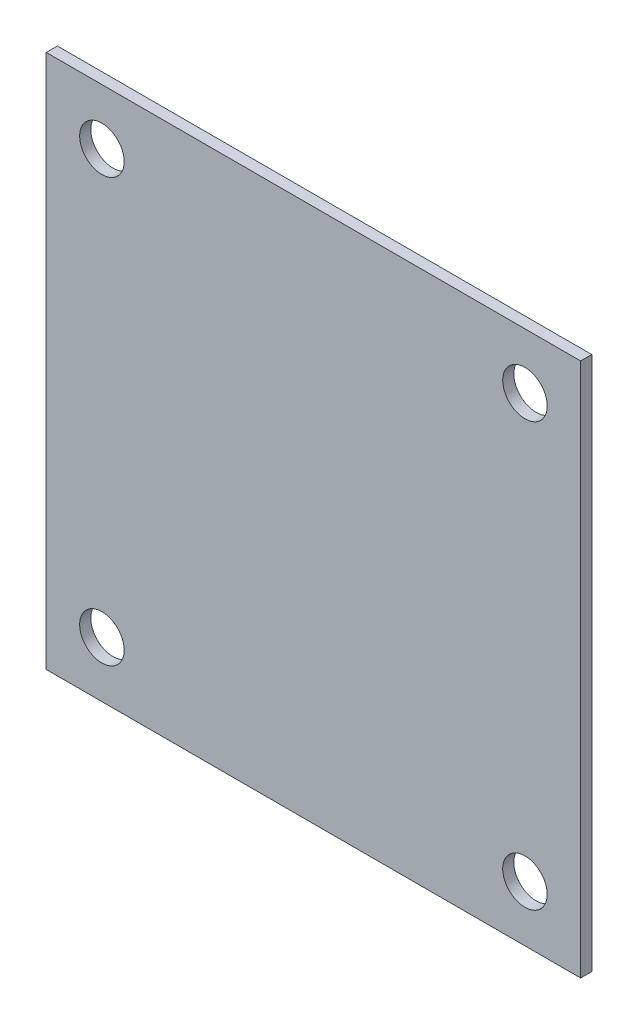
ISO-10303-21;
HEADER;
FILE_DESCRIPTION(('STEP AP214'),'2;1');
FILE_NAME('part.step','',(''),(''),'','','');
FILE_SCHEMA(('AUTOMOTIVE_DESIGN { 1 0 10303 214 1 1 1 1 }'));
ENDSEC;
DATA;
#1=APPLICATION_CONTEXT('core data for automotive mechanical design processes');
#2=APPLICATION_PROTOCOL_DEFINITION('international standard','automotive_design',2000,#1);
#3=PRODUCT_CONTEXT('',#1,'mechanical');
#4=PRODUCT('Part','Part','',(#3));
#5=PRODUCT_RELATED_PRODUCT_CATEGORY('part','',(#4));
#6=PRODUCT_DEFINITION_FORMATION('','',#4);
#7=PRODUCT_DEFINITION_CONTEXT('part definition',#1,'design');
#8=PRODUCT_DEFINITION('design','',#6,#7);
#9=PRODUCT_DEFINITION_SHAPE('','',#8);
#10=(LENGTH_UNIT() NAMED_UNIT(*) SI_UNIT(.MILLI.,.METRE.));
#11=(NAMED_UNIT(*) PLANE_ANGLE_UNIT() SI_UNIT($,.RADIAN.));
#12=(NAMED_UNIT(*) SI_UNIT($,.STERADIAN.) SOLID_ANGLE_UNIT());
#13=UNCERTAINTY_MEASURE_WITH_UNIT(LENGTH_MEASURE(1.E-05),#10,'distance_accuracy_value','');
#14=(GEOMETRIC_REPRESENTATION_CONTEXT(3) GLOBAL_UNCERTAINTY_ASSIGNED_CONTEXT((#13)) GLOBAL_UNIT_ASSIGNED_CONTEXT((#10,
#11,#12)) REPRESENTATION_CONTEXT('',''));
#15=CARTESIAN_POINT('',(0.,0.,0.));
#16=DIRECTION('',(0.,0.,1.));
#17=DIRECTION('',(1.,0.,0.));
#18=AXIS2_PLACEMENT_3D('',#15,#16,#17);
#19=CARTESIAN_POINT('',(0.,0.,3.175));
#20=DIRECTION('',(0.,0.,1.));
#21=DIRECTION('',(1.,0.,0.));
#22=AXIS2_PLACEMENT_3D('',#19,#20,#21);
#23=PLANE('',#22);
#24=CARTESIAN_POINT('',(60.325,-60.325,3.175));
#25=DIRECTION('',(0.,0.,1.));
#26=DIRECTION('',(1.,0.,0.));
#27=AXIS2_PLACEMENT_3D('',#24,#25,#26);
#28=CIRCLE('',#27,6.35);
#29=CARTESIAN_POINT('',(66.675,-60.325,3.175));
#30=VERTEX_POINT('',#29);
#31=EDGE_CURVE('E148',#30,#30,#28,.T.);
#32=ORIENTED_EDGE('',*,*,#31,.F.);
#33=EDGE_LOOP('',(#32));
#34=FACE_BOUND('',#33,.T.);
#35=CARTESIAN_POINT('',(-60.325,60.325,3.175));
#36=DIRECTION('',(0.,0.,1.));
#37=DIRECTION('',(1.,0.,0.));
#38=AXIS2_PLACEMENT_3D('',#35,#36,#37);
#39=CIRCLE('',#38,6.35);
#40=CARTESIAN_POINT('',(-53.975,60.325,3.175));
#41=VERTEX_POINT('',#40);
#42=EDGE_CURVE('E118',#41,#41,#39,.T.);
#43=ORIENTED_EDGE('',*,*,#42,.F.);
#44=EDGE_LOOP('',(#43));
#45=FACE_BOUND('',#44,.T.);
#46=DIRECTION('',(0.,-1.,0.));
#47=VECTOR('',#46,1.);
#48=CARTESIAN_POINT('',(-76.2,76.2,3.175));
#49=LINE('',#48,#47);
#50=CARTESIAN_POINT('',(-76.2,76.2,3.175));
#51=VERTEX_POINT('',#50);
#52=CARTESIAN_POINT('',(-76.2,-76.2,3.175));
#53=VERTEX_POINT('',#52);
#54=EDGE_CURVE('E98',#51,#53,#49,.T.);
#55=ORIENTED_EDGE('',*,*,#54,.T.);
#56=DIRECTION('',(1.,0.,0.));
#57=VECTOR('',#56,1.);
#58=CARTESIAN_POINT('',(-76.2,-76.2,3.175));
#59=LINE('',#58,#57);
#60=CARTESIAN_POINT('',(76.2,-76.2,3.175));
#61=VERTEX_POINT('',#60);
#62=EDGE_CURVE('E93',#53,#61,#59,.T.);
#63=ORIENTED_EDGE('',*,*,#62,.T.);
#64=DIRECTION('',(0.,1.,0.));
#65=VECTOR('',#64,1.);
#66=CARTESIAN_POINT('',(76.2,76.2,3.175));
#67=LINE('',#66,#65);
#68=CARTESIAN_POINT('',(76.2,76.2,3.175));
#69=VERTEX_POINT('',#68);
#70=EDGE_CURVE('E96',#61,#69,#67,.T.);
#71=ORIENTED_EDGE('',*,*,#70,.T.);
#72=DIRECTION('',(-1.,0.,0.));
#73=VECTOR('',#72,1.);
#74=CARTESIAN_POINT('',(-76.2,76.2,3.175));
#75=LINE('',#74,#73);
#76=EDGE_CURVE('E63',#69,#51,#75,.T.);
#77=ORIENTED_EDGE('',*,*,#76,.T.);
#78=EDGE_LOOP('',(#55,#63,#71,#77));
#79=FACE_BOUND('',#78,.T.);
#80=CARTESIAN_POINT('',(60.325,60.325,3.175));
#81=DIRECTION('',(0.,0.,1.));
#82=DIRECTION('',(-1.,0.,0.));
#83=AXIS2_PLACEMENT_3D('',#80,#81,#82);
#84=CIRCLE('',#83,6.35);
#85=CARTESIAN_POINT('',(53.975,60.325,3.175));
#86=VERTEX_POINT('',#85);
#87=EDGE_CURVE('E140',#86,#86,#84,.T.);
#88=ORIENTED_EDGE('',*,*,#87,.F.);
#89=EDGE_LOOP('',(#88));
#90=FACE_BOUND('',#89,.T.);
#91=CARTESIAN_POINT('',(-60.325,-60.325,3.175));
#92=DIRECTION('',(0.,0.,1.));
#93=DIRECTION('',(-1.,0.,0.));
#94=AXIS2_PLACEMENT_3D('',#91,#92,#93);
#95=CIRCLE('',#94,6.35);
#96=CARTESIAN_POINT('',(-66.675,-60.325,3.175));
#97=VERTEX_POINT('',#96);
#98=EDGE_CURVE('E156',#97,#97,#95,.T.);
#99=ORIENTED_EDGE('',*,*,#98,.F.);
#100=EDGE_LOOP('',(#99));
#101=FACE_BOUND('',#100,.T.);
#102=ADVANCED_FACE('F45',(#34,#45,#79,#90,#101),#23,.T.);
#103=CARTESIAN_POINT('',(0.,0.,0.));
#104=DIRECTION('',(0.,0.,1.));
#105=DIRECTION('',(1.,0.,0.));
#106=AXIS2_PLACEMENT_3D('',#103,#104,#105);
#107=PLANE('',#106);
#108=DIRECTION('',(0.,-1.,0.));
#109=VECTOR('',#108,1.);
#110=CARTESIAN_POINT('',(-76.2,76.2,0.));
#111=LINE('',#110,#109);
#112=CARTESIAN_POINT('',(-76.2,76.2,0.));
#113=VERTEX_POINT('',#112);
#114=CARTESIAN_POINT('',(-76.2,-76.2,0.));
#115=VERTEX_POINT('',#114);
#116=EDGE_CURVE('E114',#113,#115,#111,.T.);
#117=ORIENTED_EDGE('',*,*,#116,.F.);
#118=DIRECTION('',(-1.,0.,0.));
#119=VECTOR('',#118,1.);
#120=CARTESIAN_POINT('',(-76.2,76.2,0.));
#121=LINE('',#120,#119);
#122=CARTESIAN_POINT('',(76.2,76.2,0.));
#123=VERTEX_POINT('',#122);
#124=EDGE_CURVE('E86',#123,#113,#121,.T.);
#125=ORIENTED_EDGE('',*,*,#124,.F.);
#126=DIRECTION('',(0.,1.,0.));
#127=VECTOR('',#126,1.);
#128=CARTESIAN_POINT('',(76.2,76.2,0.));
#129=LINE('',#128,#127);
#130=CARTESIAN_POINT('',(76.2,-76.2,0.));
#131=VERTEX_POINT('',#130);
#132=EDGE_CURVE('E80',#131,#123,#129,.T.);
#133=ORIENTED_EDGE('',*,*,#132,.F.);
#134=DIRECTION('',(1.,0.,0.));
#135=VECTOR('',#134,1.);
#136=CARTESIAN_POINT('',(-76.2,-76.2,0.));
#137=LINE('',#136,#135);
#138=EDGE_CURVE('E103',#115,#131,#137,.T.);
#139=ORIENTED_EDGE('',*,*,#138,.F.);
#140=EDGE_LOOP('',(#117,#125,#133,#139));
#141=FACE_BOUND('',#140,.T.);
#142=CARTESIAN_POINT('',(-60.325,60.325,0.));
#143=DIRECTION('',(0.,0.,1.));
#144=DIRECTION('',(1.,0.,0.));
#145=AXIS2_PLACEMENT_3D('',#142,#143,#144);
#146=CIRCLE('',#145,6.35);
#147=CARTESIAN_POINT('',(-53.975,60.325,0.));
#148=VERTEX_POINT('',#147);
#149=EDGE_CURVE('E136',#148,#148,#146,.T.);
#150=ORIENTED_EDGE('',*,*,#149,.T.);
#151=EDGE_LOOP('',(#150));
#152=FACE_BOUND('',#151,.T.);
#153=CARTESIAN_POINT('',(60.325,60.325,0.));
#154=DIRECTION('',(0.,0.,1.));
#155=DIRECTION('',(-1.,0.,0.));
#156=AXIS2_PLACEMENT_3D('',#153,#154,#155);
#157=CIRCLE('',#156,6.35);
#158=CARTESIAN_POINT('',(53.975,60.325,0.));
#159=VERTEX_POINT('',#158);
#160=EDGE_CURVE('E144',#159,#159,#157,.T.);
#161=ORIENTED_EDGE('',*,*,#160,.T.);
#162=EDGE_LOOP('',(#161));
#163=FACE_BOUND('',#162,.T.);
#164=CARTESIAN_POINT('',(60.325,-60.325,0.));
#165=DIRECTION('',(0.,0.,1.));
#166=DIRECTION('',(1.,0.,0.));
#167=AXIS2_PLACEMENT_3D('',#164,#165,#166);
#168=CIRCLE('',#167,6.35);
#169=CARTESIAN_POINT('',(66.675,-60.325,0.));
#170=VERTEX_POINT('',#169);
#171=EDGE_CURVE('E152',#170,#170,#168,.T.);
#172=ORIENTED_EDGE('',*,*,#171,.T.);
#173=EDGE_LOOP('',(#172));
#174=FACE_BOUND('',#173,.T.);
#175=CARTESIAN_POINT('',(-60.325,-60.325,0.));
#176=DIRECTION('',(0.,0.,1.));
#177=DIRECTION('',(-1.,0.,0.));
#178=AXIS2_PLACEMENT_3D('',#175,#176,#177);
#179=CIRCLE('',#178,6.35);
#180=CARTESIAN_POINT('',(-66.675,-60.325,0.));
#181=VERTEX_POINT('',#180);
#182=EDGE_CURVE('E160',#181,#181,#179,.T.);
#183=ORIENTED_EDGE('',*,*,#182,.T.);
#184=EDGE_LOOP('',(#183));
#185=FACE_BOUND('',#184,.T.);
#186=ADVANCED_FACE('F131',(#141,#152,#163,#174,#185),#107,.F.);
#187=CARTESIAN_POINT('',(-76.2,76.2,3.175));
#188=DIRECTION('',(1.,0.,0.));
#189=DIRECTION('',(0.,1.,0.));
#190=AXIS2_PLACEMENT_3D('',#187,#188,#189);
#191=PLANE('',#190);
#192=ORIENTED_EDGE('',*,*,#116,.T.);
#193=DIRECTION('',(0.,0.,-1.));
#194=VECTOR('',#193,1.);
#195=CARTESIAN_POINT('',(-76.2,-76.2,3.175));
#196=LINE('',#195,#194);
#197=EDGE_CURVE('E11',#53,#115,#196,.T.);
#198=ORIENTED_EDGE('',*,*,#197,.F.);
#199=ORIENTED_EDGE('',*,*,#54,.F.);
#200=DIRECTION('',(0.,0.,-1.));
#201=VECTOR('',#200,1.);
#202=CARTESIAN_POINT('',(-76.2,76.2,3.175));
#203=LINE('',#202,#201);
#204=EDGE_CURVE('E110',#51,#113,#203,.T.);
#205=ORIENTED_EDGE('',*,*,#204,.T.);
#206=EDGE_LOOP('',(#192,#198,#199,#205));
#207=FACE_BOUND('',#206,.T.);
#208=ADVANCED_FACE('F47',(#207),#191,.F.);
#209=CARTESIAN_POINT('',(-76.2,-76.2,3.175));
#210=DIRECTION('',(0.,1.,0.));
#211=DIRECTION('',(0.,0.,1.));
#212=AXIS2_PLACEMENT_3D('',#209,#210,#211);
#213=PLANE('',#212);
#214=ORIENTED_EDGE('',*,*,#138,.T.);
#215=DIRECTION('',(0.,0.,-1.));
#216=VECTOR('',#215,1.);
#217=CARTESIAN_POINT('',(76.2,-76.2,3.175));
#218=LINE('',#217,#216);
#219=EDGE_CURVE('E55',#61,#131,#218,.T.);
#220=ORIENTED_EDGE('',*,*,#219,.F.);
#221=ORIENTED_EDGE('',*,*,#62,.F.);
#222=ORIENTED_EDGE('',*,*,#197,.T.);
#223=EDGE_LOOP('',(#214,#220,#221,#222));
#224=FACE_BOUND('',#223,.T.);
#225=ADVANCED_FACE('F102',(#224),#213,.F.);
#226=CARTESIAN_POINT('',(76.2,76.2,3.175));
#227=DIRECTION('',(-1.,0.,0.));
#228=DIRECTION('',(0.,-1.,0.));
#229=AXIS2_PLACEMENT_3D('',#226,#227,#228);
#230=PLANE('',#229);
#231=ORIENTED_EDGE('',*,*,#132,.T.);
#232=DIRECTION('',(0.,0.,-1.));
#233=VECTOR('',#232,1.);
#234=CARTESIAN_POINT('',(76.2,76.2,3.175));
#235=LINE('',#234,#233);
#236=EDGE_CURVE('E105',#69,#123,#235,.T.);
#237=ORIENTED_EDGE('',*,*,#236,.F.);
#238=ORIENTED_EDGE('',*,*,#70,.F.);
#239=ORIENTED_EDGE('',*,*,#219,.T.);
#240=EDGE_LOOP('',(#231,#237,#238,#239));
#241=FACE_BOUND('',#240,.T.);
#242=ADVANCED_FACE('F106',(#241),#230,.F.);
#243=CARTESIAN_POINT('',(-76.2,76.2,3.175));
#244=DIRECTION('',(0.,-1.,0.));
#245=DIRECTION('',(0.,0.,-1.));
#246=AXIS2_PLACEMENT_3D('',#243,#244,#245);
#247=PLANE('',#246);
#248=ORIENTED_EDGE('',*,*,#124,.T.);
#249=ORIENTED_EDGE('',*,*,#204,.F.);
#250=ORIENTED_EDGE('',*,*,#76,.F.);
#251=ORIENTED_EDGE('',*,*,#236,.T.);
#252=EDGE_LOOP('',(#248,#249,#250,#251));
#253=FACE_BOUND('',#252,.T.);
#254=ADVANCED_FACE('F128',(#253),#247,.F.);
#255=CARTESIAN_POINT('',(-60.325,60.325,3.175));
#256=DIRECTION('',(0.,0.,-1.));
#257=DIRECTION('',(-1.,0.,0.));
#258=AXIS2_PLACEMENT_3D('',#255,#256,#257);
#259=CYLINDRICAL_SURFACE('',#258,6.35);
#260=ORIENTED_EDGE('',*,*,#42,.T.);
#261=EDGE_LOOP('',(#260));
#262=FACE_BOUND('',#261,.T.);
#263=ORIENTED_EDGE('',*,*,#149,.F.);
#264=EDGE_LOOP('',(#263));
#265=FACE_BOUND('',#264,.T.);
#266=ADVANCED_FACE('F181',(#262,#265),#259,.F.);
#267=CARTESIAN_POINT('',(60.325,60.325,3.175));
#268=DIRECTION('',(0.,0.,-1.));
#269=DIRECTION('',(-1.,0.,0.));
#270=AXIS2_PLACEMENT_3D('',#267,#268,#269);
#271=CYLINDRICAL_SURFACE('',#270,6.35);
#272=ORIENTED_EDGE('',*,*,#87,.T.);
#273=EDGE_LOOP('',(#272));
#274=FACE_BOUND('',#273,.T.);
#275=ORIENTED_EDGE('',*,*,#160,.F.);
#276=EDGE_LOOP('',(#275));
#277=FACE_BOUND('',#276,.T.);
#278=ADVANCED_FACE('F226',(#274,#277),#271,.F.);
#279=CARTESIAN_POINT('',(60.325,-60.325,3.175));
#280=DIRECTION('',(0.,0.,-1.));
#281=DIRECTION('',(-1.,0.,0.));
#282=AXIS2_PLACEMENT_3D('',#279,#280,#281);
#283=CYLINDRICAL_SURFACE('',#282,6.35);
#284=ORIENTED_EDGE('',*,*,#31,.T.);
#285=EDGE_LOOP('',(#284));
#286=FACE_BOUND('',#285,.T.);
#287=ORIENTED_EDGE('',*,*,#171,.F.);
#288=EDGE_LOOP('',(#287));
#289=FACE_BOUND('',#288,.T.);
#290=ADVANCED_FACE('F234',(#286,#289),#283,.F.);
#291=CARTESIAN_POINT('',(-60.325,-60.325,3.175));
#292=DIRECTION('',(0.,0.,-1.));
#293=DIRECTION('',(-1.,0.,0.));
#294=AXIS2_PLACEMENT_3D('',#291,#292,#293);
#295=CYLINDRICAL_SURFACE('',#294,6.35);
#296=ORIENTED_EDGE('',*,*,#98,.T.);
#297=EDGE_LOOP('',(#296));
#298=FACE_BOUND('',#297,.T.);
#299=ORIENTED_EDGE('',*,*,#182,.F.);
#300=EDGE_LOOP('',(#299));
#301=FACE_BOUND('',#300,.T.);
#302=ADVANCED_FACE('F168',(#298,#301),#295,.F.);
#303=CLOSED_SHELL('',(#102,#186,#208,#225,#242,#254,#266,#278,#290,#302));
#304=MANIFOLD_SOLID_BREP('B2',#303);
#305=ADVANCED_BREP_SHAPE_REPRESENTATION('',(#18,#304),#14);
#306=SHAPE_DEFINITION_REPRESENTATION(#9,#305);
ENDSEC;
END-ISO-10303-21;
